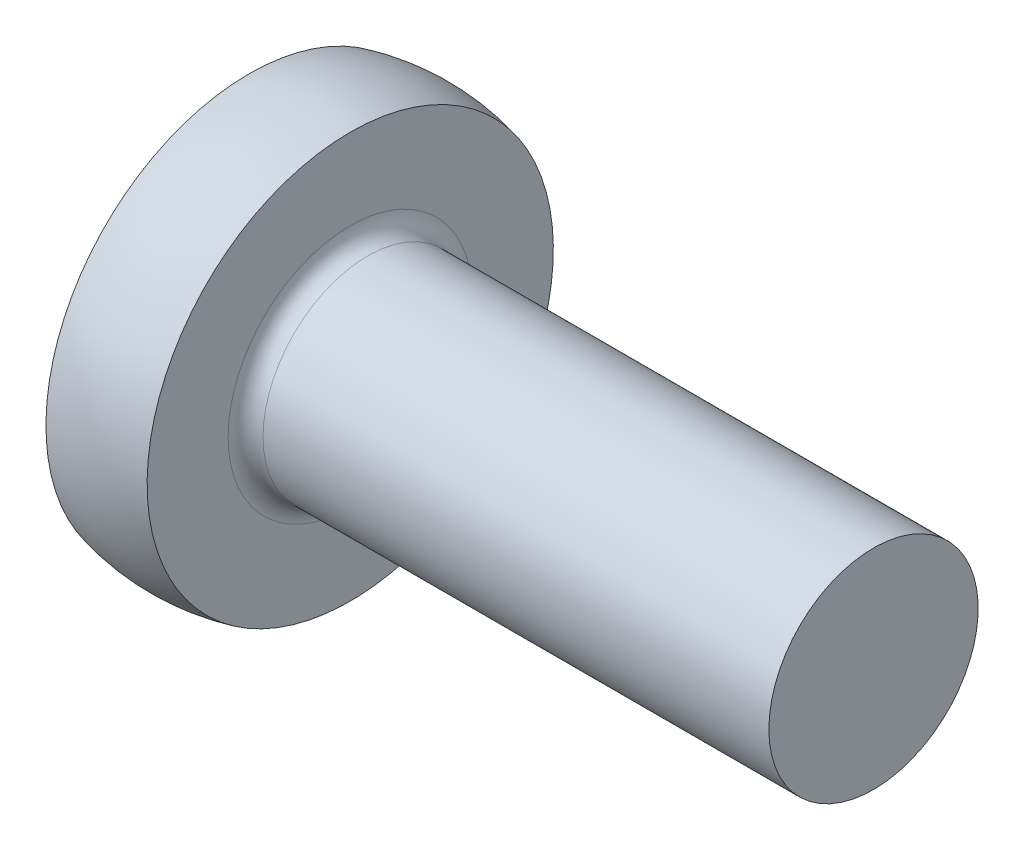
ISO-10303-21;
HEADER;
FILE_DESCRIPTION(('STEP AP214'),'2;1');
FILE_NAME('part.step','',(''),(''),'','','');
FILE_SCHEMA(('AUTOMOTIVE_DESIGN { 1 0 10303 214 1 1 1 1 }'));
ENDSEC;
DATA;
#1=APPLICATION_CONTEXT('core data for automotive mechanical design processes');
#2=APPLICATION_PROTOCOL_DEFINITION('international standard','automotive_design',2000,#1);
#3=PRODUCT_CONTEXT('',#1,'mechanical');
#4=PRODUCT('Part','Part','',(#3));
#5=PRODUCT_RELATED_PRODUCT_CATEGORY('part','',(#4));
#6=PRODUCT_DEFINITION_FORMATION('','',#4);
#7=PRODUCT_DEFINITION_CONTEXT('part definition',#1,'design');
#8=PRODUCT_DEFINITION('design','',#6,#7);
#9=PRODUCT_DEFINITION_SHAPE('','',#8);
#10=(LENGTH_UNIT() NAMED_UNIT(*) SI_UNIT(.MILLI.,.METRE.));
#11=(NAMED_UNIT(*) PLANE_ANGLE_UNIT() SI_UNIT($,.RADIAN.));
#12=(NAMED_UNIT(*) SI_UNIT($,.STERADIAN.) SOLID_ANGLE_UNIT());
#13=UNCERTAINTY_MEASURE_WITH_UNIT(LENGTH_MEASURE(1.E-05),#10,'distance_accuracy_value','');
#14=(GEOMETRIC_REPRESENTATION_CONTEXT(3) GLOBAL_UNCERTAINTY_ASSIGNED_CONTEXT((#13)) GLOBAL_UNIT_ASSIGNED_CONTEXT((#10,
#11,#12)) REPRESENTATION_CONTEXT('',''));
#15=CARTESIAN_POINT('',(0.,0.,0.));
#16=DIRECTION('',(0.,0.,1.));
#17=DIRECTION('',(1.,0.,0.));
#18=AXIS2_PLACEMENT_3D('',#15,#16,#17);
#19=CARTESIAN_POINT('',(3.58,0.,0.));
#20=DIRECTION('',(-1.,0.,0.));
#21=DIRECTION('',(0.,0.,1.));
#22=AXIS2_PLACEMENT_3D('',#19,#20,#21);
#23=PLANE('',#22);
#24=CARTESIAN_POINT('',(3.58,0.,0.));
#25=DIRECTION('',(-1.,0.,0.));
#26=DIRECTION('',(0.,0.,1.));
#27=AXIS2_PLACEMENT_3D('',#24,#25,#26);
#28=CIRCLE('',#27,0.6);
#29=CARTESIAN_POINT('',(3.58,0.,0.6));
#30=VERTEX_POINT('',#29);
#31=EDGE_CURVE('E41',#30,#30,#28,.T.);
#32=ORIENTED_EDGE('',*,*,#31,.F.);
#33=EDGE_LOOP('',(#32));
#34=FACE_BOUND('',#33,.T.);
#35=ADVANCED_FACE('F30',(#34),#23,.F.);
#36=CARTESIAN_POINT('',(-2.31825396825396,0.,0.));
#37=DIRECTION('',(-1.,0.,0.));
#38=DIRECTION('',(0.,0.,1.));
#39=AXIS2_PLACEMENT_3D('',#36,#37,#38);
#40=CYLINDRICAL_SURFACE('',#39,0.6);
#41=CARTESIAN_POINT('',(0.68,0.,0.));
#42=DIRECTION('',(-1.,0.,0.));
#43=DIRECTION('',(0.,0.,1.));
#44=AXIS2_PLACEMENT_3D('',#41,#42,#43);
#45=CIRCLE('',#44,0.6);
#46=CARTESIAN_POINT('',(0.68,0.,0.6));
#47=VERTEX_POINT('',#46);
#48=EDGE_CURVE('E10',#47,#47,#45,.F.);
#49=ORIENTED_EDGE('',*,*,#48,.T.);
#50=EDGE_LOOP('',(#49));
#51=FACE_BOUND('',#50,.T.);
#52=ORIENTED_EDGE('',*,*,#31,.T.);
#53=EDGE_LOOP('',(#52));
#54=FACE_BOUND('',#53,.T.);
#55=ADVANCED_FACE('F64',(#51,#54),#40,.T.);
#56=CARTESIAN_POINT('',(0.58,1.16443119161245,0.));
#57=DIRECTION('',(-1.,0.,0.));
#58=DIRECTION('',(0.,0.,1.));
#59=AXIS2_PLACEMENT_3D('',#56,#57,#58);
#60=PLANE('',#59);
#61=CARTESIAN_POINT('',(0.58,0.,0.));
#62=DIRECTION('',(-1.,0.,0.));
#63=DIRECTION('',(0.,0.,1.));
#64=AXIS2_PLACEMENT_3D('',#61,#62,#63);
#65=CIRCLE('',#64,0.7);
#66=CARTESIAN_POINT('',(0.58,0.,0.7));
#67=VERTEX_POINT('',#66);
#68=EDGE_CURVE('E37',#67,#67,#65,.T.);
#69=ORIENTED_EDGE('',*,*,#68,.T.);
#70=EDGE_LOOP('',(#69));
#71=FACE_BOUND('',#70,.T.);
#72=CARTESIAN_POINT('',(0.58,0.,0.));
#73=DIRECTION('',(-1.,0.,0.));
#74=DIRECTION('',(0.,0.,1.));
#75=AXIS2_PLACEMENT_3D('',#72,#73,#74);
#76=CIRCLE('',#75,1.16443119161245);
#77=CARTESIAN_POINT('',(0.58,1.16443119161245,0.));
#78=VERTEX_POINT('',#77);
#79=EDGE_CURVE('E45',#78,#78,#76,.T.);
#80=ORIENTED_EDGE('',*,*,#79,.F.);
#81=EDGE_LOOP('',(#80));
#82=FACE_BOUND('',#81,.T.);
#83=ADVANCED_FACE('F59',(#71,#82),#60,.F.);
#84=CARTESIAN_POINT('',(0.29,0.,0.));
#85=DIRECTION('',(-1.,0.,0.));
#86=DIRECTION('',(0.,1.,0.));
#87=AXIS2_PLACEMENT_3D('',#84,#85,#86);
#88=SPHERICAL_SURFACE('',#87,1.2);
#89=CARTESIAN_POINT('',(0.,0.,0.));
#90=DIRECTION('',(-1.,0.,0.));
#91=DIRECTION('',(0.,0.,1.));
#92=AXIS2_PLACEMENT_3D('',#89,#90,#91);
#93=CIRCLE('',#92,1.16443119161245);
#94=CARTESIAN_POINT('',(0.,1.16443119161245,0.));
#95=VERTEX_POINT('',#94);
#96=EDGE_CURVE('E50',#95,#95,#93,.T.);
#97=CARTESIAN_POINT('',(0.,1.16443119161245,0.));
#98=CARTESIAN_POINT('',(0.00592120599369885,1.16590586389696,0.));
#99=CARTESIAN_POINT('',(0.0118536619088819,1.16733536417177,0.));
#100=CARTESIAN_POINT('',(0.0237396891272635,1.17010370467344,0.));
#101=CARTESIAN_POINT('',(0.0296932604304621,1.17144254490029,0.));
#102=CARTESIAN_POINT('',(0.0416201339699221,1.17402924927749,0.));
#103=CARTESIAN_POINT('',(0.0475934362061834,1.17527711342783,0.));
#104=CARTESIAN_POINT('',(0.0595583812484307,1.17768157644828,0.));
#105=CARTESIAN_POINT('',(0.0655500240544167,1.17883817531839,0.));
#106=CARTESIAN_POINT('',(0.0775502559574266,1.18105983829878,0.));
#107=CARTESIAN_POINT('',(0.0835588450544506,1.18212490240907,0.));
#108=CARTESIAN_POINT('',(0.0955915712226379,1.18416324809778,0.));
#109=CARTESIAN_POINT('',(0.101615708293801,1.1851365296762,0.));
#110=CARTESIAN_POINT('',(0.113678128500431,1.18699108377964,0.));
#111=CARTESIAN_POINT('',(0.119716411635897,1.18787235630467,0.));
#112=CARTESIAN_POINT('',(0.131805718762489,1.18954268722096,0.));
#113=CARTESIAN_POINT('',(0.137856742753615,1.19033174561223,0.));
#114=CARTESIAN_POINT('',(0.149970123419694,1.19181746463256,0.));
#115=CARTESIAN_POINT('',(0.156032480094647,1.19251412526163,0.));
#116=CARTESIAN_POINT('',(0.168167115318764,1.1938148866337,0.));
#117=CARTESIAN_POINT('',(0.174239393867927,1.19441898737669,0.));
#118=CARTESIAN_POINT('',(0.186392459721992,1.19553448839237,0.));
#119=CARTESIAN_POINT('',(0.192473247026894,1.19604588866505,0.));
#120=CARTESIAN_POINT('',(0.204641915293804,1.19697586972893,0.));
#121=CARTESIAN_POINT('',(0.210729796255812,1.19739445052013,0.));
#122=CARTESIAN_POINT('',(0.222911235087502,1.19813869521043,0.));
#123=CARTESIAN_POINT('',(0.229004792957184,1.19846435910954,0.));
#124=CARTESIAN_POINT('',(0.241196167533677,1.19902269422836,0.));
#125=CARTESIAN_POINT('',(0.247293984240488,1.19925536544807,0.));
#126=CARTESIAN_POINT('',(0.259492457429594,1.1996276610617,0.));
#127=CARTESIAN_POINT('',(0.265593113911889,1.19976728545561,0.));
#128=CARTESIAN_POINT('',(0.277795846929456,1.19995345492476,0.));
#129=CARTESIAN_POINT('',(0.283897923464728,1.2,0.));
#130=CARTESIAN_POINT('',(0.296102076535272,1.2,0.));
#131=CARTESIAN_POINT('',(0.302204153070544,1.19995345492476,0.));
#132=CARTESIAN_POINT('',(0.314406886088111,1.19976728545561,0.));
#133=CARTESIAN_POINT('',(0.320507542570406,1.1996276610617,0.));
#134=CARTESIAN_POINT('',(0.332706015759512,1.19925536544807,0.));
#135=CARTESIAN_POINT('',(0.338803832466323,1.19902269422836,0.));
#136=CARTESIAN_POINT('',(0.350995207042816,1.19846435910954,0.));
#137=CARTESIAN_POINT('',(0.357088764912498,1.19813869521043,0.));
#138=CARTESIAN_POINT('',(0.369270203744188,1.19739445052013,0.));
#139=CARTESIAN_POINT('',(0.375358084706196,1.19697586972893,0.));
#140=CARTESIAN_POINT('',(0.387526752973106,1.19604588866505,0.));
#141=CARTESIAN_POINT('',(0.393607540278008,1.19553448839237,0.));
#142=CARTESIAN_POINT('',(0.405760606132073,1.19441898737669,0.));
#143=CARTESIAN_POINT('',(0.411832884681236,1.1938148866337,0.));
#144=CARTESIAN_POINT('',(0.423967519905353,1.19251412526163,0.));
#145=CARTESIAN_POINT('',(0.430029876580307,1.19181746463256,0.));
#146=CARTESIAN_POINT('',(0.442143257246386,1.19033174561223,0.));
#147=CARTESIAN_POINT('',(0.448194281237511,1.18954268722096,0.));
#148=CARTESIAN_POINT('',(0.460283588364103,1.18787235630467,0.));
#149=CARTESIAN_POINT('',(0.466321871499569,1.18699108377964,0.));
#150=CARTESIAN_POINT('',(0.478384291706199,1.1851365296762,0.));
#151=CARTESIAN_POINT('',(0.484408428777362,1.18416324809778,0.));
#152=CARTESIAN_POINT('',(0.49644115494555,1.18212490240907,0.));
#153=CARTESIAN_POINT('',(0.502449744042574,1.18105983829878,0.));
#154=CARTESIAN_POINT('',(0.514449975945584,1.17883817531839,0.));
#155=CARTESIAN_POINT('',(0.52044161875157,1.17768157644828,0.));
#156=CARTESIAN_POINT('',(0.532406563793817,1.17527711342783,0.));
#157=CARTESIAN_POINT('',(0.538379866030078,1.17402924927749,0.));
#158=CARTESIAN_POINT('',(0.550306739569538,1.17144254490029,0.));
#159=CARTESIAN_POINT('',(0.556260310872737,1.17010370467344,0.));
#160=CARTESIAN_POINT('',(0.568146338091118,1.16733536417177,0.));
#161=CARTESIAN_POINT('',(0.574078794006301,1.16590586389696,0.));
#162=CARTESIAN_POINT('',(0.58,1.16443119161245,0.));
#163=B_SPLINE_CURVE_WITH_KNOTS('',3,(#97,#98,#99,#100,#101,#102,#103,#104,#105,#106,#107,#108,
#109,#110,#111,#112,#113,#114,#115,#116,#117,#118,#119,#120,#121,#122,#123,#124,#125,#126,#127,
#128,#129,#130,#131,#132,#133,#134,#135,#136,#137,#138,#139,#140,#141,#142,#143,#144,#145,#146,
#147,#148,#149,#150,#151,#152,#153,#154,#155,#156,#157,#158,#159,#160,#161,#162),.UNSPECIFIED.,
.F.,.F.,(4,2,2,2,2,2,2,2,2,2,2,2,2,2,2,2,2,2,2,2,2,2,2,2,2,2,2,2,2,2,2,2,4),(0.,
0.0183060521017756,0.0366121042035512,0.0549181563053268,0.0732242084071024,0.091530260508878,
0.109836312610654,0.128142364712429,0.146448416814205,0.16475446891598,0.183060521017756,
0.201366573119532,0.219672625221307,0.237978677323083,0.256284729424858,0.274590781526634,
0.29289683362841,0.311202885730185,0.329508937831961,0.347814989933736,0.366121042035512,
0.384427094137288,0.402733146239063,0.421039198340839,0.439345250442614,0.45765130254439,
0.475957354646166,0.494263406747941,0.512569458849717,0.530875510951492,0.549181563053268,
0.567487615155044,0.585793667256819),.UNSPECIFIED.);
#164=EDGE_CURVE('BSEAM56',#95,#78,#163,.T.);
#165=ORIENTED_EDGE('',*,*,#96,.F.);
#166=ORIENTED_EDGE('',*,*,#79,.T.);
#167=ORIENTED_EDGE('',*,*,#164,.T.);
#168=ORIENTED_EDGE('',*,*,#164,.F.);
#169=EDGE_LOOP('',(#165,#167,#166,#168));
#170=FACE_BOUND('',#169,.T.);
#171=ADVANCED_FACE('F56',(#170),#88,.T.);
#172=CARTESIAN_POINT('',(0.,1.16443119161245,0.));
#173=DIRECTION('',(1.,0.,0.));
#174=DIRECTION('',(0.,0.,-1.));
#175=AXIS2_PLACEMENT_3D('',#172,#173,#174);
#176=PLANE('',#175);
#177=ORIENTED_EDGE('',*,*,#96,.T.);
#178=EDGE_LOOP('',(#177));
#179=FACE_BOUND('',#178,.T.);
#180=ADVANCED_FACE('F54',(#179),#176,.F.);
#181=CARTESIAN_POINT('',(0.68,0.,0.));
#182=DIRECTION('',(-1.,0.,0.));
#183=DIRECTION('',(0.,0.,1.));
#184=AXIS2_PLACEMENT_3D('',#181,#182,#183);
#185=TOROIDAL_SURFACE('',#184,0.7,0.1);
#186=ORIENTED_EDGE('',*,*,#48,.F.);
#187=EDGE_LOOP('',(#186));
#188=FACE_BOUND('',#187,.T.);
#189=ORIENTED_EDGE('',*,*,#68,.F.);
#190=EDGE_LOOP('',(#189));
#191=FACE_BOUND('',#190,.T.);
#192=ADVANCED_FACE('F32',(#188,#191),#185,.F.);
#193=CLOSED_SHELL('',(#35,#55,#83,#171,#180,#192));
#194=MANIFOLD_SOLID_BREP('B2',#193);
#195=ADVANCED_BREP_SHAPE_REPRESENTATION('',(#18,#194),#14);
#196=SHAPE_DEFINITION_REPRESENTATION(#9,#195);
ENDSEC;
END-ISO-10303-21;
